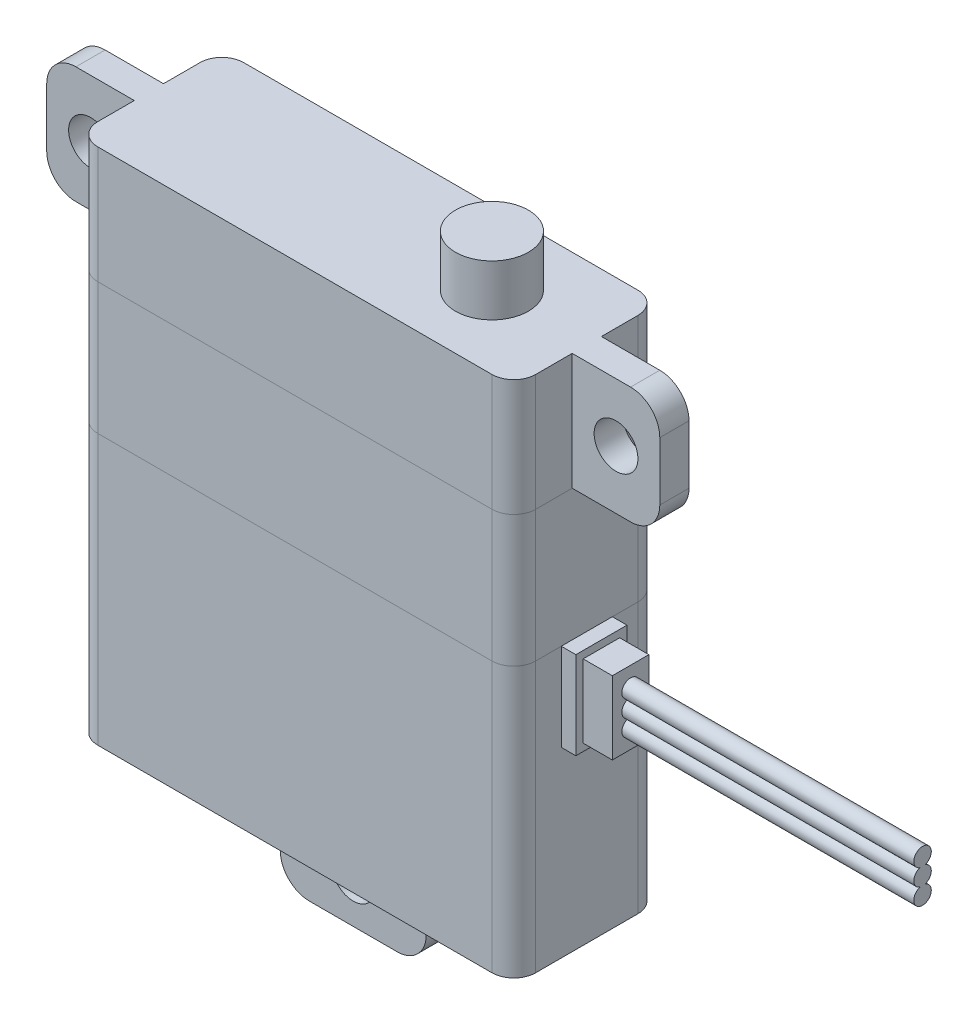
from build123d import *

# Parameters (mm, degrees)
ESQUISSE1_W             = 30
ESQUISSE1_H             = 10
BOSS_EXTRU_1_DEPTH      = 35.5
CONG_2_R                = 1.5
ESQUISSE3_W             = 10
ESQUISSE3_H             = 6
ESQUISSE3_W_2           = 6
ESQUISSE3_H_2           = 8
BOSS_EXTRU_2_DEPTH      = 1
CONG_3_R                = 2
ESQUISSE4_R             = 1.5
ENL_V_MAT_EXTRU_1_DEPTH = 42.680331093
ESQUISSE5_W             = 3.5
ESQUISSE5_H             = 6
BOSS_EXTRU_3_DEPTH      = 1
ESQUISSE6_W             = 2.5
ESQUISSE6_H             = 5
BOSS_EXTRU_4_DEPTH      = 2
BOSS_EXTRU_5_DEPTH      = 20
ESQUISSE8_R             = 2.5
BOSS_EXTRU_6_DEPTH      = 3.5


with BuildPart() as part:
    # Esquisse1 → Boss.-Extru.1 (new body)
    with BuildSketch(Plane(origin=(0, 0, 0), x_dir=(1, 0, 0), z_dir=(0, 1, 0))):
        Rectangle(ESQUISSE1_W, ESQUISSE1_H)
    extrude(amount=BOSS_EXTRU_1_DEPTH)

    # Cong_2
    cong_2_edges = [part.edges().sort_by_distance(p)[0] for p in [
        (15, 17.75, 5),
        (-15, 17.75, 5),
        (-15, 17.75, -5),
        (15, 17.75, -5),
    ]]
    fillet(cong_2_edges, radius=CONG_2_R)

    # Esquisse3 → Boss.-Extru.2 (add, symmetric)
    with BuildSketch(Plane.XY):
        with Locations((0, -3)):
            Rectangle(ESQUISSE3_W, ESQUISSE3_H)
        with Locations((-18, 31.5)):
            Rectangle(ESQUISSE3_W_2, ESQUISSE3_H_2)
        with Locations((18, 31.5)):
            Rectangle(ESQUISSE3_W_2, ESQUISSE3_H_2)
    extrude(amount=BOSS_EXTRU_2_DEPTH, both=True)

    # Cong_3
    cong_3_edges = [part.edges().sort_by_distance(p)[0] for p in [
        (21, 27.5, 0),
        (21, 35.5, 0),
        (-5, -6, 0),
        (5, -6, 0),
        (-21, 35.5, 0),
        (-21, 27.5, 0),
    ]]
    fillet(cong_3_edges, radius=CONG_3_R)

    # Esquisse4 → Enl_v. mat.-Extru.1 (cut, through all)
    with BuildSketch(Plane.XY.offset(1)):
        with Locations((18, 31.5)):
            Circle(ESQUISSE4_R)
        with Locations((-18, 31.5)):
            Circle(ESQUISSE4_R)
        with Locations((0, -3)):
            Circle(ESQUISSE4_R)
    extrude(amount=-ENL_V_MAT_EXTRU_1_DEPTH, mode=Mode.SUBTRACT)



with BuildPart() as body_2:
    # Esquisse5 → Boss.-Extru.3 (new body)
    with BuildSketch(Plane(origin=(15, 0, 0), x_dir=(0, 0, -1), z_dir=(1, 0, 0))):
        with Locations((0, 15.5)):
            Rectangle(ESQUISSE5_W, ESQUISSE5_H)
    extrude(amount=BOSS_EXTRU_3_DEPTH)


with BuildPart() as part_1:
    add(part.part)

    add(body_2.part)  # Boss.-Extru.4 merges body 2
    # Esquisse6 → Boss.-Extru.4 (add)
    with BuildSketch(Plane(origin=(16, 0, 0), x_dir=(0, 0, -1), z_dir=(1, 0, 0))):
        with Locations((0, 15.5)):
            Rectangle(ESQUISSE6_W, ESQUISSE6_H)
    extrude(amount=BOSS_EXTRU_4_DEPTH)


with BuildPart() as body_2_2:
    # Esquisse7 → Boss.-Extru.5 (new body)
    with BuildSketch(Plane(origin=(18, 0, 0), x_dir=(0, 0, -1), z_dir=(1, 0, 0))):
        with BuildLine():
            ThreePointArc((-0.171391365, 16.075), (-0.6, 15.5), (-0.171391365, 14.925))
            ThreePointArc((-0.171391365, 14.925), (0, 13.75), (0.171391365, 14.925))
            ThreePointArc((0.171391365, 14.925), (0.6, 15.5), (0.171391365, 16.075))
            ThreePointArc((0.171391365, 16.075), (0, 17.25), (-0.171391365, 16.075))
        make_face()
    extrude(amount=BOSS_EXTRU_5_DEPTH)


with BuildPart() as body_3:
    # Esquisse8 → Boss.-Extru.6 (new body)
    with BuildSketch(Plane(origin=(0, 35.5, 0), x_dir=(1, 0, 0), z_dir=(0, 1, 0))):
        with Locations(Location((8.5, 0, 0), (0, 0, 270))):
            Circle(ESQUISSE8_R)
    extrude(amount=BOSS_EXTRU_6_DEPTH)


solid = Compound([part_1.part, body_2_2.part, body_3.part])
